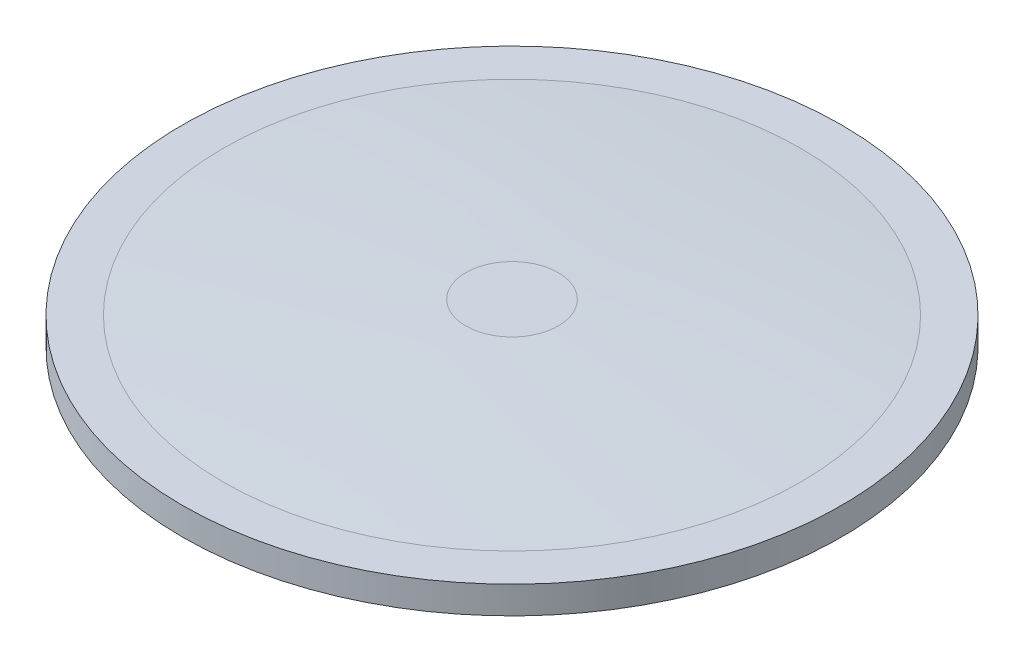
from build123d import *

# Parameters (mm, degrees)
CUT_EXTRUDE1_REACH = 109.95
SKETCH2_R          = 5.5499


with BuildPart() as part:
    # Sketch1 → Base-Revolve (revolve)
    with BuildSketch(Plane.XY, mode=Mode.PRIVATE) as base_revolve_sk:
        with BuildLine():
            Line((0, 6.35), (0, 3.175))
            Line((0, 3.175), (-13.986493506, 3.175))
            ThreePointArc((-13.986493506, 3.175), (-40.946655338, 1.948766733), (-67.864238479, 0))
            ThreePointArc((-67.864238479, 0), (-40.946655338, -1.948766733), (-13.986493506, -3.175))
            Line((-13.986493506, -3.175), (0, -3.175))
            Line((0, -3.175), (0, -6.35))
            Line((0, -6.35), (-10.68476688, -6.35))
            ThreePointArc((-10.68476688, -6.35), (-38.765487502, -5.15318309), (-66.802, -3.175))
            Line((-66.802, -3.175), (-76.2, -3.175))
            Line((-76.2, -3.175), (-76.2, 3.175))
            Line((-76.2, 3.175), (-66.802, 3.175))
            ThreePointArc((-66.802, 3.175), (-38.765487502, 5.15318309), (-10.68476688, 6.35))
            Line((-10.68476688, 6.35), (0, 6.35))
        make_face()
    revolve(base_revolve_sk.sketch.rotate(Axis((0, 10.16, 0), (0, -1, 0)), 270), axis=Axis((0, 10.16, 0), (0, -1, 0)))

    # Sketch2 → Cut-Extrude1 (cut, up to next)
    with BuildSketch(Plane(origin=(0, 0, 0), x_dir=(1, 0, 0), z_dir=(0, 1, 0)), mode=Mode.PRIVATE) as cut_extrude1_sk1:
        with Locations(Location((0, 0, 0), (0, 0, 270))):
            Circle(SKETCH2_R)
    cut_extrude1_tool1 = extrude(cut_extrude1_sk1.sketch, amount=-CUT_EXTRUDE1_REACH, mode=Mode.PRIVATE) & part.part
    add(cut_extrude1_tool1.solids().sort_by_distance((0, 0, 0))[0], mode=Mode.SUBTRACT)


solid = part.part
